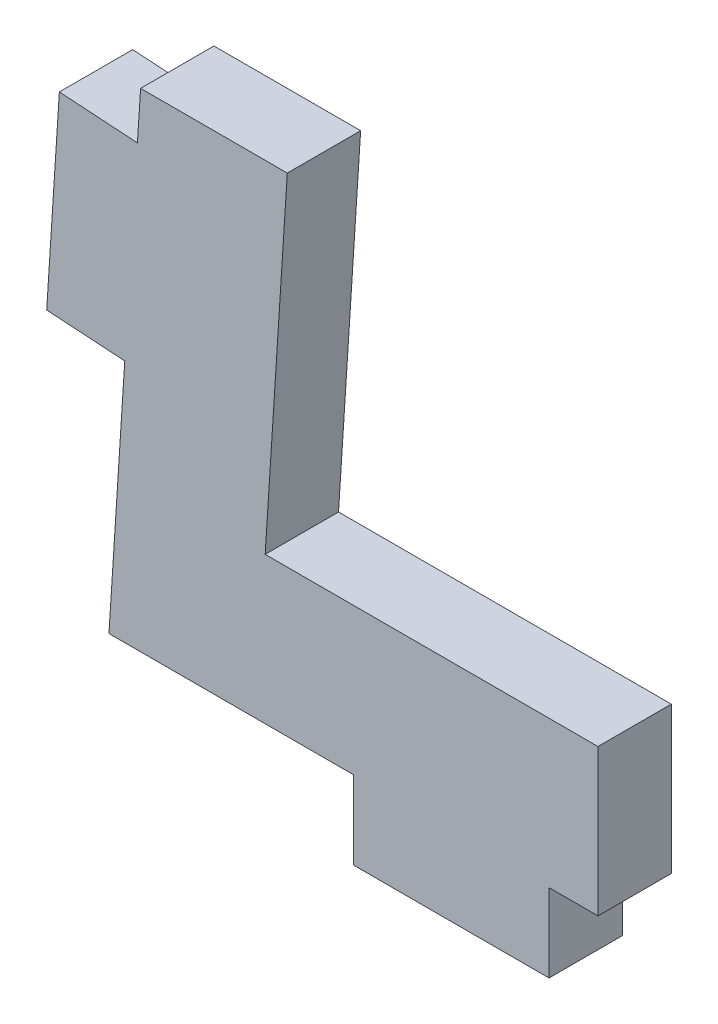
from build123d import *

# Parameters (mm, degrees)
EXTRUDE_1_DEPTH = 3
SKETCH_1_3_W    = 8
SKETCH_1_3_H    = 3.2
EXTRUDE_2_DEPTH = 3


with BuildPart() as part:
    # Sketch 1 → Extrude 1 (new body)
    with BuildSketch(Plane.XY):
        Polygon((20, 6), (20, 0), (0, 0), (1.294129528, 19.958086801), (7.294129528, 19.958086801), (6.389054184, 6), align=None)
    extrude(amount=EXTRUDE_1_DEPTH)

    # Sketch 1_3 → Extrude 2 (add)
    with BuildSketch(Plane.XY):
        Polygon((-2.546229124, 10.186104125), (0.647064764, 9.979043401), (1.164716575, 17.962278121), (-2.028577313, 18.169338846), align=None)
        with Locations((14, -1.6)):
            Rectangle(SKETCH_1_3_W, SKETCH_1_3_H)
    extrude(amount=EXTRUDE_2_DEPTH)


solid = part.part
